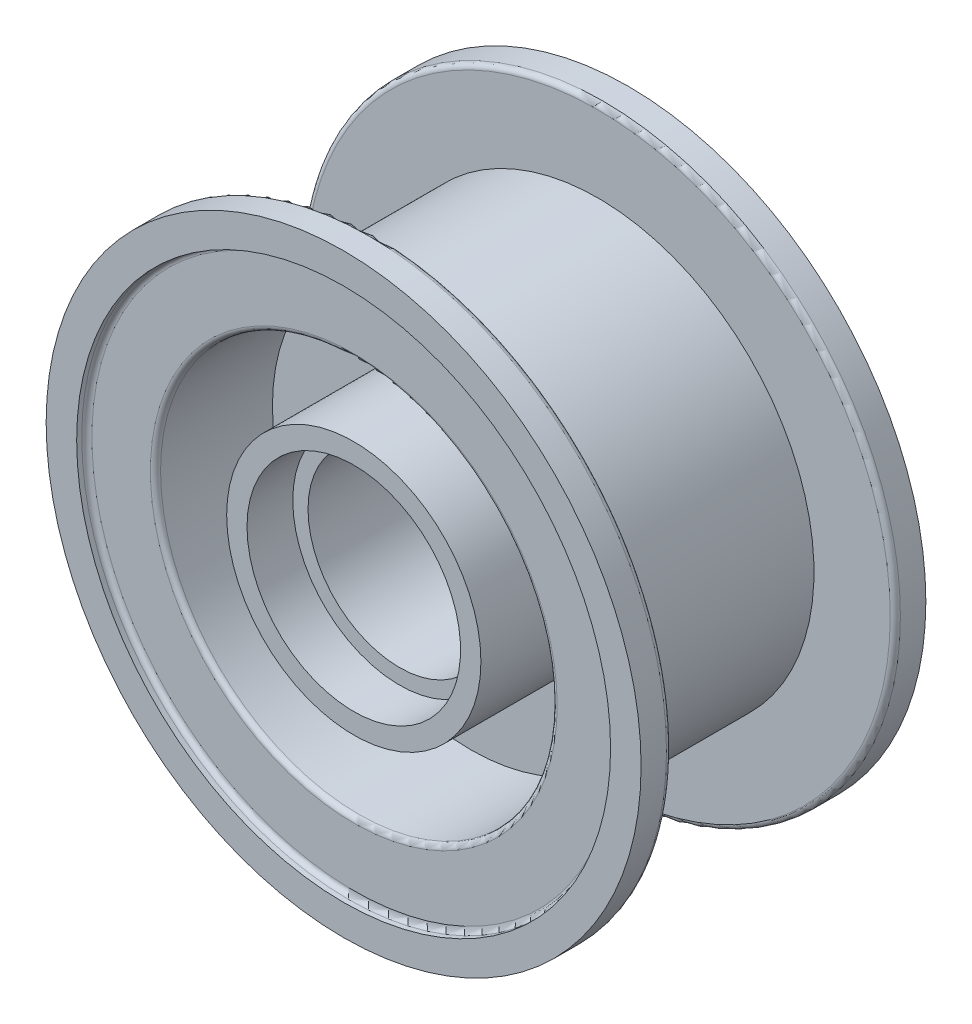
from build123d import *

# Parameters (mm, degrees)
EXTRUSION1_DEPTH        = 28
EXTRUSION1_DEPTH_BACK   = 28
ESQUISSE1_R             = 58.5
ESQUISSE2_R             = 12.5
ENL_V_MAT_EXTRU_1_DEPTH = 77.354946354
ESQUISSE3_W             = 16
ESQUISSE3_H             = 44
ESQUISSE4_R             = 39
ESQUISSE4_R_2           = 25
ENL_V_MAT_EXTRU_2_DEPTH = 25
ENL_V_START             = -25
ESQUISSE5_R             = 39
ESQUISSE5_R_2           = 25
ENL_V_MAT_EXTRU_3_DEPTH = 25
ESQUISSE6_R             = 52.5
ENL_V_MAT_EXTRU_4_DEPTH = 2
ENL_V_START_2           = -2
ESQUISSE7_R             = 52.5
ENL_V_MAT_EXTRU_5_DEPTH = 2
CONG_1_R                = 1
CONG_2_R                = 1
ESQUISSE8_R             = 21
ENL_V_MAT_EXTRU_6_DEPTH = 9
ESQUISSE9_R             = 18
ENL_V_MAT_EXTRU_7_DEPTH = 77


with BuildPart() as part:
    # Esquisse1 → Extrusion1 (new, two sides: drawn at the far end of the back side and taken through both)
    with BuildSketch(Plane.XY.offset(-EXTRUSION1_DEPTH_BACK)):
        Circle(ESQUISSE1_R)
    extrude(amount=EXTRUSION1_DEPTH + EXTRUSION1_DEPTH_BACK)

    # Esquisse2 → Enl_v. mat.-Extru.1 (cut)
    with BuildSketch(Plane.XY.offset(28)):
        Circle(ESQUISSE2_R)
    extrude(amount=-ENL_V_MAT_EXTRU_1_DEPTH, mode=Mode.SUBTRACT)

    # Esquisse3 → Enl_vement de mati_re-R_volution1 (revolve, cut)
    with BuildSketch(Plane(origin=(0, 0, 0), x_dir=(1, 0, 0), z_dir=(0, 1, 0)), mode=Mode.PRIVATE) as enl_vement_de_mati_re_r_volution1_sk:
        with Locations((50.5, 0)):
            Rectangle(ESQUISSE3_W, ESQUISSE3_H)
    revolve(enl_vement_de_mati_re_r_volution1_sk.sketch.rotate(Axis((0, 0, 0), (0, 0, 1)), 180), axis=Axis((0, 0, 0), (0, 0, 1)), mode=Mode.SUBTRACT)

    # Esquisse4 → Enl_v. mat.-Extru.2 (cut)
    with BuildSketch(Plane.XY.offset(28)):
        Circle(ESQUISSE4_R)
        Circle(ESQUISSE4_R_2, mode=Mode.SUBTRACT)
    extrude(amount=-ENL_V_MAT_EXTRU_2_DEPTH, mode=Mode.SUBTRACT)

    # Esquisse5 → Enl_v. mat.-Extru.3 (cut)
    with BuildSketch(Plane(origin=(0, 0, -28), x_dir=(-1, 0, 0), z_dir=(0, 0, -1)).offset(ENL_V_START)):
        with Locations(Location((0, 0, 0), (0, 0, 180))):
            Circle(ESQUISSE5_R)
        with Locations(Location((0, 0, 0), (0, 0, 180))):
            Circle(ESQUISSE5_R_2, mode=Mode.SUBTRACT)
    extrude(amount=ENL_V_MAT_EXTRU_3_DEPTH, mode=Mode.SUBTRACT)

    # Esquisse6 → Enl_v. mat.-Extru.4 (cut)
    with BuildSketch(Plane(origin=(0, 0, -28), x_dir=(-1, 0, 0), z_dir=(0, 0, -1))):
        Circle(ESQUISSE6_R)
    extrude(amount=-ENL_V_MAT_EXTRU_4_DEPTH, mode=Mode.SUBTRACT)

    # Esquisse7 → Enl_v. mat.-Extru.5 (cut)
    with BuildSketch(Plane.XY.offset(28).offset(ENL_V_START_2)):
        with Locations(Location((0, 0, 0), (0, 0, 180))):
            Circle(ESQUISSE7_R)
    extrude(amount=ENL_V_MAT_EXTRU_5_DEPTH, mode=Mode.SUBTRACT)

    # Cong_1
    cong_1_edges = [part.edges().sort_by_distance(p)[0] for p in [
        (-39, 0, -26),
        (52.5, 0, -26),
        (-39, 0, 26),
        (52.5, 0, 26),
    ]]
    fillet(cong_1_edges, radius=CONG_1_R)

    # Cong_2
    cong_2_edges = [part.edges().sort_by_distance(p)[0] for p in [
        (-58.5, 0, 22),
        (-58.5, 0, -22),
    ]]
    fillet(cong_2_edges, radius=CONG_2_R)

    # Esquisse8 → Enl_v. mat.-Extru.6 (cut)
    with BuildSketch(Plane(origin=(0, 0, -26), x_dir=(-1, 0, 0), z_dir=(0, 0, -1))):
        Circle(ESQUISSE8_R)
    enl_v_mat_extru_6 = extrude(amount=-ENL_V_MAT_EXTRU_6_DEPTH, mode=Mode.SUBTRACT)

    # Esquisse9 → Enl_v. mat.-Extru.7 (cut)
    with BuildSketch(Plane(origin=(0, 0, -17), x_dir=(-1, 0, 0), z_dir=(0, 0, -1))):
        Circle(ESQUISSE9_R)
    extrude(amount=-ENL_V_MAT_EXTRU_7_DEPTH, mode=Mode.SUBTRACT)

    # Sym_trie1: Enl_v. mat.-Extru.6 across plane
    add(enl_v_mat_extru_6.mirror(Plane.XY), mode=Mode.SUBTRACT)


solid = part.part
